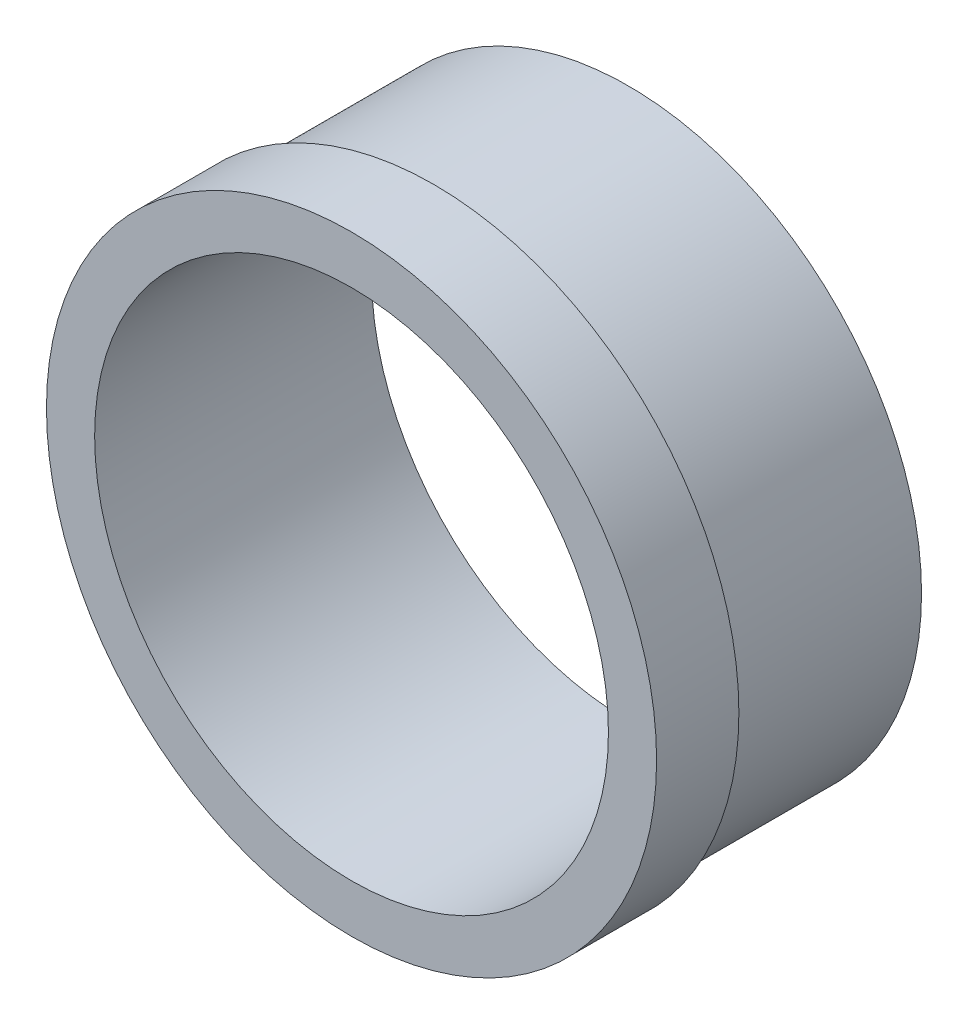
ISO-10303-21;
HEADER;
FILE_DESCRIPTION(('STEP AP214'),'2;1');
FILE_NAME('part.step','',(''),(''),'','','');
FILE_SCHEMA(('AUTOMOTIVE_DESIGN { 1 0 10303 214 1 1 1 1 }'));
ENDSEC;
DATA;
#1=APPLICATION_CONTEXT('core data for automotive mechanical design processes');
#2=APPLICATION_PROTOCOL_DEFINITION('international standard','automotive_design',2000,#1);
#3=PRODUCT_CONTEXT('',#1,'mechanical');
#4=PRODUCT('Part','Part','',(#3));
#5=PRODUCT_RELATED_PRODUCT_CATEGORY('part','',(#4));
#6=PRODUCT_DEFINITION_FORMATION('','',#4);
#7=PRODUCT_DEFINITION_CONTEXT('part definition',#1,'design');
#8=PRODUCT_DEFINITION('design','',#6,#7);
#9=PRODUCT_DEFINITION_SHAPE('','',#8);
#10=(LENGTH_UNIT() NAMED_UNIT(*) SI_UNIT(.MILLI.,.METRE.));
#11=(NAMED_UNIT(*) PLANE_ANGLE_UNIT() SI_UNIT($,.RADIAN.));
#12=(NAMED_UNIT(*) SI_UNIT($,.STERADIAN.) SOLID_ANGLE_UNIT());
#13=UNCERTAINTY_MEASURE_WITH_UNIT(LENGTH_MEASURE(1.E-05),#10,'distance_accuracy_value','');
#14=(GEOMETRIC_REPRESENTATION_CONTEXT(3) GLOBAL_UNCERTAINTY_ASSIGNED_CONTEXT((#13)) GLOBAL_UNIT_ASSIGNED_CONTEXT((#10,
#11,#12)) REPRESENTATION_CONTEXT('',''));
#15=CARTESIAN_POINT('',(0.,0.,0.));
#16=DIRECTION('',(0.,0.,1.));
#17=DIRECTION('',(1.,0.,0.));
#18=AXIS2_PLACEMENT_3D('',#15,#16,#17);
#19=CARTESIAN_POINT('',(79.7999948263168,79.7999948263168,69.));
#20=DIRECTION('',(0.,0.,1.));
#21=DIRECTION('',(-1.,0.,0.));
#22=AXIS2_PLACEMENT_3D('',#19,#20,#21);
#23=PLANE('',#22);
#24=CARTESIAN_POINT('',(-1.38777878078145E-13,0.,69.));
#25=DIRECTION('',(0.,0.,-1.));
#26=DIRECTION('',(-1.,0.,0.));
#27=AXIS2_PLACEMENT_3D('',#24,#25,#26);
#28=CIRCLE('',#27,64.);
#29=CARTESIAN_POINT('',(-64.0000000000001,0.,69.));
#30=VERTEX_POINT('',#29);
#31=EDGE_CURVE('E9',#30,#30,#28,.T.);
#32=ORIENTED_EDGE('',*,*,#31,.T.);
#33=EDGE_LOOP('',(#32));
#34=FACE_BOUND('',#33,.T.);
#35=CARTESIAN_POINT('',(-1.09450663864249E-13,1.45716771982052E-13,69.));
#36=DIRECTION('',(0.,0.,-1.));
#37=DIRECTION('',(-1.,0.,0.));
#38=AXIS2_PLACEMENT_3D('',#35,#36,#37);
#39=CIRCLE('',#38,76.);
#40=CARTESIAN_POINT('',(0.,76.0000000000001,69.));
#41=VERTEX_POINT('',#40);
#42=EDGE_CURVE('E71',#41,#41,#39,.T.);
#43=ORIENTED_EDGE('',*,*,#42,.F.);
#44=EDGE_LOOP('',(#43));
#45=FACE_BOUND('',#44,.T.);
#46=ADVANCED_FACE('F14',(#34,#45),#23,.T.);
#47=CARTESIAN_POINT('',(0.,0.,48.5));
#48=DIRECTION('',(0.,0.,1.));
#49=DIRECTION('',(1.,0.,0.));
#50=AXIS2_PLACEMENT_3D('',#47,#48,#49);
#51=CYLINDRICAL_SURFACE('',#50,76.);
#52=CARTESIAN_POINT('',(0.,0.,48.5));
#53=DIRECTION('',(0.,0.,1.));
#54=DIRECTION('',(1.,0.,0.));
#55=AXIS2_PLACEMENT_3D('',#52,#53,#54);
#56=CIRCLE('',#55,76.);
#57=CARTESIAN_POINT('',(0.,76.0000000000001,48.5));
#58=VERTEX_POINT('',#57);
#59=EDGE_CURVE('E24',#58,#58,#56,.T.);
#60=ORIENTED_EDGE('',*,*,#59,.T.);
#61=DIRECTION('',(0.,0.,-1.));
#62=VECTOR('',#61,1.);
#63=CARTESIAN_POINT('',(0.,76.0000000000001,58.75));
#64=LINE('',#63,#62);
#65=EDGE_CURVE('E59',#41,#58,#64,.T.);
#66=ORIENTED_EDGE('',*,*,#65,.F.);
#67=ORIENTED_EDGE('',*,*,#42,.T.);
#68=ORIENTED_EDGE('',*,*,#65,.T.);
#69=EDGE_LOOP('',(#60,#66,#67,#68));
#70=FACE_BOUND('',#69,.T.);
#71=ADVANCED_FACE('F67',(#70),#51,.T.);
#72=CARTESIAN_POINT('',(-79.7999948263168,-79.7999948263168,48.5));
#73=DIRECTION('',(0.,0.,-1.));
#74=DIRECTION('',(0.,1.,0.));
#75=AXIS2_PLACEMENT_3D('',#72,#73,#74);
#76=PLANE('',#75);
#77=CARTESIAN_POINT('',(0.,0.,48.5));
#78=DIRECTION('',(0.,0.,-1.));
#79=DIRECTION('',(-1.,0.,0.));
#80=AXIS2_PLACEMENT_3D('',#77,#78,#79);
#81=CIRCLE('',#80,73.);
#82=CARTESIAN_POINT('',(73.,0.,48.5));
#83=VERTEX_POINT('',#82);
#84=EDGE_CURVE('E52',#83,#83,#81,.T.);
#85=ORIENTED_EDGE('',*,*,#84,.F.);
#86=EDGE_LOOP('',(#85));
#87=FACE_BOUND('',#86,.T.);
#88=ORIENTED_EDGE('',*,*,#59,.F.);
#89=EDGE_LOOP('',(#88));
#90=FACE_BOUND('',#89,.T.);
#91=ADVANCED_FACE('F56',(#87,#90),#76,.T.);
#92=CARTESIAN_POINT('',(0.,0.,0.));
#93=DIRECTION('',(0.,0.,1.));
#94=DIRECTION('',(1.,0.,0.));
#95=AXIS2_PLACEMENT_3D('',#92,#93,#94);
#96=CYLINDRICAL_SURFACE('',#95,73.);
#97=CARTESIAN_POINT('',(0.,0.,0.));
#98=DIRECTION('',(0.,0.,1.));
#99=DIRECTION('',(1.,0.,0.));
#100=AXIS2_PLACEMENT_3D('',#97,#98,#99);
#101=CIRCLE('',#100,73.);
#102=CARTESIAN_POINT('',(73.,0.,0.));
#103=VERTEX_POINT('',#102);
#104=EDGE_CURVE('E44',#103,#103,#101,.T.);
#105=ORIENTED_EDGE('',*,*,#104,.T.);
#106=DIRECTION('',(0.,0.,-1.));
#107=VECTOR('',#106,1.);
#108=CARTESIAN_POINT('',(73.,0.,24.25));
#109=LINE('',#108,#107);
#110=EDGE_CURVE('E49',#83,#103,#109,.T.);
#111=ORIENTED_EDGE('',*,*,#110,.F.);
#112=ORIENTED_EDGE('',*,*,#84,.T.);
#113=ORIENTED_EDGE('',*,*,#110,.T.);
#114=EDGE_LOOP('',(#105,#111,#112,#113));
#115=FACE_BOUND('',#114,.T.);
#116=ADVANCED_FACE('F51',(#115),#96,.T.);
#117=CARTESIAN_POINT('',(-76.6499936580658,76.6499936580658,0.));
#118=DIRECTION('',(0.,0.,-1.));
#119=DIRECTION('',(1.,0.,0.));
#120=AXIS2_PLACEMENT_3D('',#117,#118,#119);
#121=PLANE('',#120);
#122=CARTESIAN_POINT('',(0.,0.,0.));
#123=DIRECTION('',(0.,0.,1.));
#124=DIRECTION('',(1.,0.,0.));
#125=AXIS2_PLACEMENT_3D('',#122,#123,#124);
#126=CIRCLE('',#125,64.0000000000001);
#127=CARTESIAN_POINT('',(-64.0000000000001,0.,0.));
#128=VERTEX_POINT('',#127);
#129=EDGE_CURVE('E53',#128,#128,#126,.T.);
#130=ORIENTED_EDGE('',*,*,#129,.T.);
#131=EDGE_LOOP('',(#130));
#132=FACE_BOUND('',#131,.T.);
#133=ORIENTED_EDGE('',*,*,#104,.F.);
#134=EDGE_LOOP('',(#133));
#135=FACE_BOUND('',#134,.T.);
#136=ADVANCED_FACE('F84',(#132,#135),#121,.T.);
#137=CARTESIAN_POINT('',(-1.38777878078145E-13,0.,69.));
#138=DIRECTION('',(0.,0.,-1.));
#139=DIRECTION('',(-1.,0.,0.));
#140=AXIS2_PLACEMENT_3D('',#137,#138,#139);
#141=CYLINDRICAL_SURFACE('',#140,64.);
#142=ORIENTED_EDGE('',*,*,#129,.F.);
#143=DIRECTION('',(0.,0.,-1.));
#144=VECTOR('',#143,1.);
#145=CARTESIAN_POINT('',(-64.0000000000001,0.,34.5));
#146=LINE('',#145,#144);
#147=EDGE_CURVE('E18',#30,#128,#146,.T.);
#148=ORIENTED_EDGE('',*,*,#147,.F.);
#149=ORIENTED_EDGE('',*,*,#31,.F.);
#150=ORIENTED_EDGE('',*,*,#147,.T.);
#151=EDGE_LOOP('',(#142,#148,#149,#150));
#152=FACE_BOUND('',#151,.T.);
#153=ADVANCED_FACE('F16',(#152),#141,.F.);
#154=CLOSED_SHELL('',(#46,#71,#91,#116,#136,#153));
#155=MANIFOLD_SOLID_BREP('B1',#154);
#156=ADVANCED_BREP_SHAPE_REPRESENTATION('',(#18,#155),#14);
#157=SHAPE_DEFINITION_REPRESENTATION(#9,#156);
ENDSEC;
END-ISO-10303-21;
